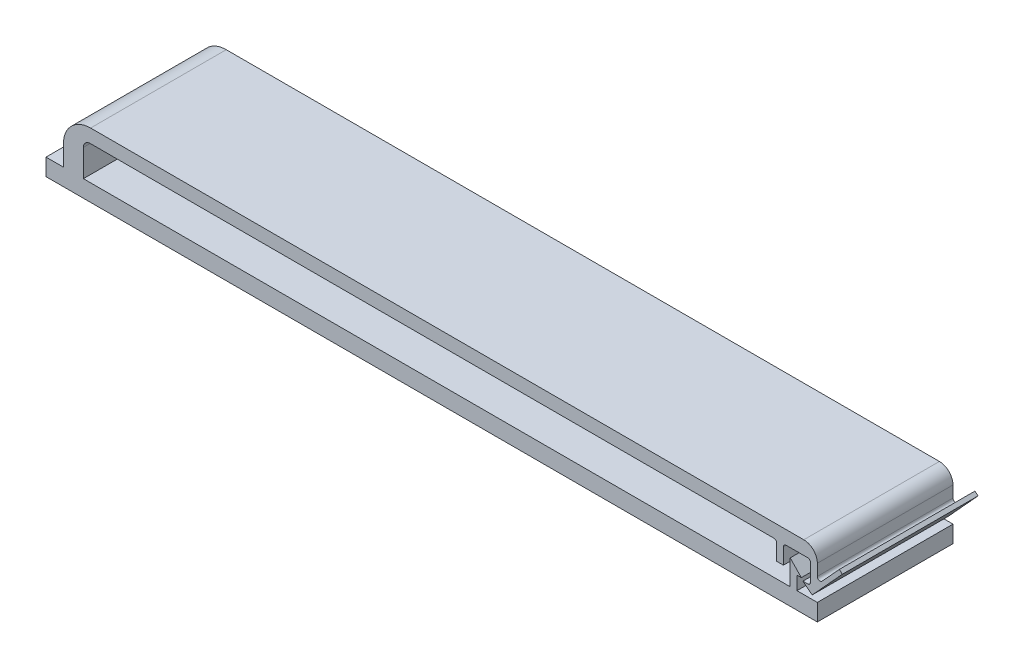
ISO-10303-21;
HEADER;
FILE_DESCRIPTION(('STEP AP214'),'2;1');
FILE_NAME('part.step','',(''),(''),'','','');
FILE_SCHEMA(('AUTOMOTIVE_DESIGN { 1 0 10303 214 1 1 1 1 }'));
ENDSEC;
DATA;
#1=APPLICATION_CONTEXT('core data for automotive mechanical design processes');
#2=APPLICATION_PROTOCOL_DEFINITION('international standard','automotive_design',2000,#1);
#3=PRODUCT_CONTEXT('',#1,'mechanical');
#4=PRODUCT('Part','Part','',(#3));
#5=PRODUCT_RELATED_PRODUCT_CATEGORY('part','',(#4));
#6=PRODUCT_DEFINITION_FORMATION('','',#4);
#7=PRODUCT_DEFINITION_CONTEXT('part definition',#1,'design');
#8=PRODUCT_DEFINITION('design','',#6,#7);
#9=PRODUCT_DEFINITION_SHAPE('','',#8);
#10=(LENGTH_UNIT() NAMED_UNIT(*) SI_UNIT(.MILLI.,.METRE.));
#11=(NAMED_UNIT(*) PLANE_ANGLE_UNIT() SI_UNIT($,.RADIAN.));
#12=(NAMED_UNIT(*) SI_UNIT($,.STERADIAN.) SOLID_ANGLE_UNIT());
#13=UNCERTAINTY_MEASURE_WITH_UNIT(LENGTH_MEASURE(1.E-05),#10,'distance_accuracy_value','');
#14=(GEOMETRIC_REPRESENTATION_CONTEXT(3) GLOBAL_UNCERTAINTY_ASSIGNED_CONTEXT((#13)) GLOBAL_UNIT_ASSIGNED_CONTEXT((#10,
#11,#12)) REPRESENTATION_CONTEXT('',''));
#15=CARTESIAN_POINT('',(0.,0.,0.));
#16=DIRECTION('',(0.,0.,1.));
#17=DIRECTION('',(1.,0.,0.));
#18=AXIS2_PLACEMENT_3D('',#15,#16,#17);
#19=CARTESIAN_POINT('',(0.,0.,-12.7));
#20=DIRECTION('',(-1.,0.,0.));
#21=DIRECTION('',(0.,0.,1.));
#22=AXIS2_PLACEMENT_3D('',#19,#20,#21);
#23=PLANE('',#22);
#24=DIRECTION('',(0.,-1.,0.));
#25=VECTOR('',#24,1.);
#26=CARTESIAN_POINT('',(0.,0.,0.));
#27=LINE('',#26,#25);
#28=CARTESIAN_POINT('',(0.,1.5875,0.));
#29=VERTEX_POINT('',#28);
#30=CARTESIAN_POINT('',(0.,0.,0.));
#31=VERTEX_POINT('',#30);
#32=EDGE_CURVE('E363',#29,#31,#27,.T.);
#33=ORIENTED_EDGE('',*,*,#32,.F.);
#34=DIRECTION('',(0.,0.,1.));
#35=VECTOR('',#34,1.);
#36=CARTESIAN_POINT('',(0.,1.5875,-12.7));
#37=LINE('',#36,#35);
#38=CARTESIAN_POINT('',(0.,1.5875,-12.7));
#39=VERTEX_POINT('',#38);
#40=EDGE_CURVE('E271',#39,#29,#37,.T.);
#41=ORIENTED_EDGE('',*,*,#40,.F.);
#42=DIRECTION('',(0.,-1.,0.));
#43=VECTOR('',#42,1.);
#44=CARTESIAN_POINT('',(0.,0.,-12.7));
#45=LINE('',#44,#43);
#46=CARTESIAN_POINT('',(0.,0.,-12.7));
#47=VERTEX_POINT('',#46);
#48=EDGE_CURVE('E265',#39,#47,#45,.T.);
#49=ORIENTED_EDGE('',*,*,#48,.T.);
#50=DIRECTION('',(0.,0.,1.));
#51=VECTOR('',#50,1.);
#52=CARTESIAN_POINT('',(0.,0.,-12.7));
#53=LINE('',#52,#51);
#54=EDGE_CURVE('E247',#47,#31,#53,.T.);
#55=ORIENTED_EDGE('',*,*,#54,.T.);
#56=EDGE_LOOP('',(#33,#41,#49,#55));
#57=FACE_BOUND('',#56,.T.);
#58=ADVANCED_FACE('F34',(#57),#23,.T.);
#59=CARTESIAN_POINT('',(0.,1.5875,-12.7));
#60=DIRECTION('',(0.,1.,0.));
#61=DIRECTION('',(0.,0.,1.));
#62=AXIS2_PLACEMENT_3D('',#59,#60,#61);
#63=PLANE('',#62);
#64=DIRECTION('',(-1.,0.,0.));
#65=VECTOR('',#64,1.);
#66=CARTESIAN_POINT('',(0.,1.5875,0.));
#67=LINE('',#66,#65);
#68=CARTESIAN_POINT('',(1.63545364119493,1.5875,0.));
#69=VERTEX_POINT('',#68);
#70=EDGE_CURVE('E272',#69,#29,#67,.T.);
#71=ORIENTED_EDGE('',*,*,#70,.F.);
#72=DIRECTION('',(0.,0.,1.));
#73=VECTOR('',#72,1.);
#74=CARTESIAN_POINT('',(1.63545364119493,1.5875,-12.7));
#75=LINE('',#74,#73);
#76=CARTESIAN_POINT('',(1.63545364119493,1.5875,-12.7));
#77=VERTEX_POINT('',#76);
#78=EDGE_CURVE('E452',#77,#69,#75,.T.);
#79=ORIENTED_EDGE('',*,*,#78,.F.);
#80=DIRECTION('',(-1.,0.,0.));
#81=VECTOR('',#80,1.);
#82=CARTESIAN_POINT('',(0.,1.5875,-12.7));
#83=LINE('',#82,#81);
#84=EDGE_CURVE('E258',#77,#39,#83,.T.);
#85=ORIENTED_EDGE('',*,*,#84,.T.);
#86=ORIENTED_EDGE('',*,*,#40,.T.);
#87=EDGE_LOOP('',(#71,#79,#85,#86));
#88=FACE_BOUND('',#87,.T.);
#89=ADVANCED_FACE('F533',(#88),#63,.T.);
#90=CARTESIAN_POINT('',(1.63545364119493,1.5875,-12.7));
#91=DIRECTION('',(-1.,0.,0.));
#92=DIRECTION('',(0.,-1.,0.));
#93=AXIS2_PLACEMENT_3D('',#90,#91,#92);
#94=PLANE('',#93);
#95=DIRECTION('',(0.,-1.,0.));
#96=VECTOR('',#95,1.);
#97=CARTESIAN_POINT('',(1.63545364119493,1.5875,0.));
#98=LINE('',#97,#96);
#99=CARTESIAN_POINT('',(1.63545364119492,3.4925,0.));
#100=VERTEX_POINT('',#99);
#101=EDGE_CURVE('E275',#100,#69,#98,.T.);
#102=ORIENTED_EDGE('',*,*,#101,.F.);
#103=DIRECTION('',(0.,0.,1.));
#104=VECTOR('',#103,1.);
#105=CARTESIAN_POINT('',(1.63545364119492,3.4925,-12.7));
#106=LINE('',#105,#104);
#107=CARTESIAN_POINT('',(1.63545364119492,3.4925,-12.7));
#108=VERTEX_POINT('',#107);
#109=EDGE_CURVE('E454',#108,#100,#106,.T.);
#110=ORIENTED_EDGE('',*,*,#109,.F.);
#111=DIRECTION('',(0.,-1.,0.));
#112=VECTOR('',#111,1.);
#113=CARTESIAN_POINT('',(1.63545364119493,1.5875,-12.7));
#114=LINE('',#113,#112);
#115=EDGE_CURVE('E359',#108,#77,#114,.T.);
#116=ORIENTED_EDGE('',*,*,#115,.T.);
#117=ORIENTED_EDGE('',*,*,#78,.T.);
#118=EDGE_LOOP('',(#102,#110,#116,#117));
#119=FACE_BOUND('',#118,.T.);
#120=ADVANCED_FACE('F537',(#119),#94,.T.);
#121=CARTESIAN_POINT('',(4.17545364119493,3.4925,-12.7));
#122=DIRECTION('',(0.,0.,1.));
#123=DIRECTION('',(1.,0.,0.));
#124=AXIS2_PLACEMENT_3D('',#121,#122,#123);
#125=CYLINDRICAL_SURFACE('',#124,2.54);
#126=CARTESIAN_POINT('',(4.17545364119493,3.4925,0.));
#127=DIRECTION('',(0.,0.,1.));
#128=DIRECTION('',(-1.,0.,0.));
#129=AXIS2_PLACEMENT_3D('',#126,#127,#128);
#130=CIRCLE('',#129,2.54);
#131=CARTESIAN_POINT('',(4.17545364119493,6.0325,0.));
#132=VERTEX_POINT('',#131);
#133=EDGE_CURVE('E445',#132,#100,#130,.T.);
#134=ORIENTED_EDGE('',*,*,#133,.F.);
#135=DIRECTION('',(0.,0.,1.));
#136=VECTOR('',#135,1.);
#137=CARTESIAN_POINT('',(4.17545364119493,6.0325,-12.7));
#138=LINE('',#137,#136);
#139=CARTESIAN_POINT('',(4.17545364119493,6.0325,-12.7));
#140=VERTEX_POINT('',#139);
#141=EDGE_CURVE('E456',#140,#132,#138,.T.);
#142=ORIENTED_EDGE('',*,*,#141,.F.);
#143=CARTESIAN_POINT('',(4.17545364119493,3.4925,-12.7));
#144=DIRECTION('',(0.,0.,1.));
#145=DIRECTION('',(-1.,0.,0.));
#146=AXIS2_PLACEMENT_3D('',#143,#144,#145);
#147=CIRCLE('',#146,2.54);
#148=EDGE_CURVE('E356',#140,#108,#147,.T.);
#149=ORIENTED_EDGE('',*,*,#148,.T.);
#150=ORIENTED_EDGE('',*,*,#109,.T.);
#151=EDGE_LOOP('',(#134,#142,#149,#150));
#152=FACE_BOUND('',#151,.T.);
#153=ADVANCED_FACE('F646',(#152),#125,.T.);
#154=CARTESIAN_POINT('',(4.17545364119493,6.0325,-12.7));
#155=DIRECTION('',(0.,1.,0.));
#156=DIRECTION('',(0.,0.,1.));
#157=AXIS2_PLACEMENT_3D('',#154,#155,#156);
#158=PLANE('',#157);
#159=DIRECTION('',(-1.,0.,0.));
#160=VECTOR('',#159,1.);
#161=CARTESIAN_POINT('',(4.17545364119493,6.0325,0.));
#162=LINE('',#161,#160);
#163=CARTESIAN_POINT('',(70.9422,6.0325,0.));
#164=VERTEX_POINT('',#163);
#165=EDGE_CURVE('E443',#164,#132,#162,.T.);
#166=ORIENTED_EDGE('',*,*,#165,.F.);
#167=DIRECTION('',(0.,0.,1.));
#168=VECTOR('',#167,1.);
#169=CARTESIAN_POINT('',(70.9422,6.0325,-12.7));
#170=LINE('',#169,#168);
#171=CARTESIAN_POINT('',(70.9422,6.0325,-12.7));
#172=VERTEX_POINT('',#171);
#173=EDGE_CURVE('E42',#164,#172,#170,.F.);
#174=ORIENTED_EDGE('',*,*,#173,.T.);
#175=DIRECTION('',(-1.,0.,0.));
#176=VECTOR('',#175,1.);
#177=CARTESIAN_POINT('',(4.17545364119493,6.0325,-12.7));
#178=LINE('',#177,#176);
#179=EDGE_CURVE('E354',#172,#140,#178,.T.);
#180=ORIENTED_EDGE('',*,*,#179,.T.);
#181=ORIENTED_EDGE('',*,*,#141,.T.);
#182=EDGE_LOOP('',(#166,#174,#180,#181));
#183=FACE_BOUND('',#182,.T.);
#184=ADVANCED_FACE('F643',(#183),#158,.T.);
#185=CARTESIAN_POINT('',(72.2122,6.0325,-12.7));
#186=DIRECTION('',(1.,0.,0.));
#187=DIRECTION('',(0.,0.,-1.));
#188=AXIS2_PLACEMENT_3D('',#185,#186,#187);
#189=PLANE('',#188);
#190=DIRECTION('',(0.,1.,0.));
#191=VECTOR('',#190,1.);
#192=CARTESIAN_POINT('',(72.2122,6.0325,-12.7));
#193=LINE('',#192,#191);
#194=CARTESIAN_POINT('',(72.2122,3.69855569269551,-12.7));
#195=VERTEX_POINT('',#194);
#196=CARTESIAN_POINT('',(72.2122,4.7625,-12.7));
#197=VERTEX_POINT('',#196);
#198=EDGE_CURVE('E351',#195,#197,#193,.T.);
#199=ORIENTED_EDGE('',*,*,#198,.T.);
#200=DIRECTION('',(0.,0.,1.));
#201=VECTOR('',#200,1.);
#202=CARTESIAN_POINT('',(72.2122,4.7625,-12.7));
#203=LINE('',#202,#201);
#204=CARTESIAN_POINT('',(72.2122,4.7625,0.));
#205=VERTEX_POINT('',#204);
#206=EDGE_CURVE('E451',#197,#205,#203,.T.);
#207=ORIENTED_EDGE('',*,*,#206,.T.);
#208=DIRECTION('',(0.,1.,0.));
#209=VECTOR('',#208,1.);
#210=CARTESIAN_POINT('',(72.2122,6.0325,0.));
#211=LINE('',#210,#209);
#212=CARTESIAN_POINT('',(72.2122,3.69855569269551,0.));
#213=VERTEX_POINT('',#212);
#214=EDGE_CURVE('E441',#213,#205,#211,.T.);
#215=ORIENTED_EDGE('',*,*,#214,.F.);
#216=DIRECTION('',(0.,0.,1.));
#217=VECTOR('',#216,1.);
#218=CARTESIAN_POINT('',(72.2122,3.69855569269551,-12.7));
#219=LINE('',#218,#217);
#220=EDGE_CURVE('E459',#195,#213,#219,.T.);
#221=ORIENTED_EDGE('',*,*,#220,.F.);
#222=EDGE_LOOP('',(#199,#207,#215,#221));
#223=FACE_BOUND('',#222,.T.);
#224=ADVANCED_FACE('F515',(#223),#189,.T.);
#225=CARTESIAN_POINT('',(72.4662,3.69855569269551,-12.7));
#226=DIRECTION('',(0.,0.,1.));
#227=DIRECTION('',(1.,0.,0.));
#228=AXIS2_PLACEMENT_3D('',#225,#226,#227);
#229=CYLINDRICAL_SURFACE('',#228,0.254000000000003);
#230=CARTESIAN_POINT('',(72.4662,3.69855569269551,0.));
#231=DIRECTION('',(0.,0.,-1.));
#232=DIRECTION('',(-1.,0.,0.));
#233=AXIS2_PLACEMENT_3D('',#230,#231,#232);
#234=CIRCLE('',#233,0.254000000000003);
#235=CARTESIAN_POINT('',(72.6536517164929,3.52715600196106,0.));
#236=VERTEX_POINT('',#235);
#237=EDGE_CURVE('E438',#236,#213,#234,.T.);
#238=ORIENTED_EDGE('',*,*,#237,.F.);
#239=DIRECTION('',(0.,0.,1.));
#240=VECTOR('',#239,1.);
#241=CARTESIAN_POINT('',(72.6536517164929,3.52715600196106,-12.7));
#242=LINE('',#241,#240);
#243=CARTESIAN_POINT('',(72.6536517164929,3.52715600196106,-12.7));
#244=VERTEX_POINT('',#243);
#245=EDGE_CURVE('E461',#244,#236,#242,.T.);
#246=ORIENTED_EDGE('',*,*,#245,.F.);
#247=CARTESIAN_POINT('',(72.4662,3.69855569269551,-12.7));
#248=DIRECTION('',(0.,0.,-1.));
#249=DIRECTION('',(-1.,0.,0.));
#250=AXIS2_PLACEMENT_3D('',#247,#248,#249);
#251=CIRCLE('',#250,0.254000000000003);
#252=EDGE_CURVE('E348',#244,#195,#251,.T.);
#253=ORIENTED_EDGE('',*,*,#252,.T.);
#254=ORIENTED_EDGE('',*,*,#220,.T.);
#255=EDGE_LOOP('',(#238,#246,#253,#254));
#256=FACE_BOUND('',#255,.T.);
#257=ADVANCED_FACE('F523',(#256),#229,.F.);
#258=CARTESIAN_POINT('',(74.2725780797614,5.29769901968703,-12.7));
#259=DIRECTION('',(-0.737998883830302,0.674801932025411,0.));
#260=DIRECTION('',(-0.674801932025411,-0.737998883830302,0.));
#261=AXIS2_PLACEMENT_3D('',#258,#259,#260);
#262=PLANE('',#261);
#263=DIRECTION('',(-0.674801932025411,-0.737998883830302,0.));
#264=VECTOR('',#263,1.);
#265=CARTESIAN_POINT('',(74.2725780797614,5.29769901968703,0.));
#266=LINE('',#265,#264);
#267=CARTESIAN_POINT('',(74.2725780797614,5.29769901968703,0.));
#268=VERTEX_POINT('',#267);
#269=EDGE_CURVE('E435',#268,#236,#266,.T.);
#270=ORIENTED_EDGE('',*,*,#269,.F.);
#271=DIRECTION('',(0.,0.,1.));
#272=VECTOR('',#271,1.);
#273=CARTESIAN_POINT('',(74.2725780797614,5.29769901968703,-12.7));
#274=LINE('',#273,#272);
#275=CARTESIAN_POINT('',(74.2725780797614,5.29769901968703,-12.7));
#276=VERTEX_POINT('',#275);
#277=EDGE_CURVE('E463',#276,#268,#274,.T.);
#278=ORIENTED_EDGE('',*,*,#277,.F.);
#279=DIRECTION('',(-0.674801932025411,-0.737998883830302,0.));
#280=VECTOR('',#279,1.);
#281=CARTESIAN_POINT('',(74.2725780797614,5.29769901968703,-12.7));
#282=LINE('',#281,#280);
#283=EDGE_CURVE('E345',#276,#244,#282,.T.);
#284=ORIENTED_EDGE('',*,*,#283,.T.);
#285=ORIENTED_EDGE('',*,*,#245,.T.);
#286=EDGE_LOOP('',(#270,#278,#284,#285));
#287=FACE_BOUND('',#286,.T.);
#288=ADVANCED_FACE('F634',(#287),#262,.T.);
#289=CARTESIAN_POINT('',(74.5537556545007,5.04059948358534,-12.7));
#290=DIRECTION('',(0.674801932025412,0.737998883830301,0.));
#291=DIRECTION('',(-0.737998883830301,0.674801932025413,0.));
#292=AXIS2_PLACEMENT_3D('',#289,#290,#291);
#293=PLANE('',#292);
#294=DIRECTION('',(-0.737998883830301,0.674801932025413,0.));
#295=VECTOR('',#294,1.);
#296=CARTESIAN_POINT('',(74.5537556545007,5.04059948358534,0.));
#297=LINE('',#296,#295);
#298=CARTESIAN_POINT('',(74.5537556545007,5.04059948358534,0.));
#299=VERTEX_POINT('',#298);
#300=EDGE_CURVE('E432',#299,#268,#297,.T.);
#301=ORIENTED_EDGE('',*,*,#300,.F.);
#302=DIRECTION('',(0.,0.,1.));
#303=VECTOR('',#302,1.);
#304=CARTESIAN_POINT('',(74.5537556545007,5.04059948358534,-12.7));
#305=LINE('',#304,#303);
#306=CARTESIAN_POINT('',(74.5537556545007,5.04059948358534,-12.7));
#307=VERTEX_POINT('',#306);
#308=EDGE_CURVE('E465',#307,#299,#305,.T.);
#309=ORIENTED_EDGE('',*,*,#308,.F.);
#310=DIRECTION('',(-0.737998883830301,0.674801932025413,0.));
#311=VECTOR('',#310,1.);
#312=CARTESIAN_POINT('',(74.5537556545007,5.04059948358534,-12.7));
#313=LINE('',#312,#311);
#314=EDGE_CURVE('E342',#307,#276,#313,.T.);
#315=ORIENTED_EDGE('',*,*,#314,.T.);
#316=ORIENTED_EDGE('',*,*,#277,.T.);
#317=EDGE_LOOP('',(#301,#309,#315,#316));
#318=FACE_BOUND('',#317,.T.);
#319=ADVANCED_FACE('F630',(#318),#293,.T.);
#320=CARTESIAN_POINT('',(74.5537556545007,5.04059948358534,-12.7));
#321=DIRECTION('',(0.737998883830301,-0.674801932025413,0.));
#322=DIRECTION('',(0.674801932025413,0.737998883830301,0.));
#323=AXIS2_PLACEMENT_3D('',#320,#321,#322);
#324=PLANE('',#323);
#325=DIRECTION('',(0.674801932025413,0.737998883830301,0.));
#326=VECTOR('',#325,1.);
#327=CARTESIAN_POINT('',(74.5537556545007,5.04059948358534,0.));
#328=LINE('',#327,#326);
#329=CARTESIAN_POINT('',(71.7330861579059,1.95576697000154,0.));
#330=VERTEX_POINT('',#329);
#331=EDGE_CURVE('E429',#330,#299,#328,.T.);
#332=ORIENTED_EDGE('',*,*,#331,.F.);
#333=DIRECTION('',(0.,0.,1.));
#334=VECTOR('',#333,1.);
#335=CARTESIAN_POINT('',(71.7330861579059,1.95576697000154,-12.7));
#336=LINE('',#335,#334);
#337=CARTESIAN_POINT('',(71.7330861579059,1.95576697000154,-12.7));
#338=VERTEX_POINT('',#337);
#339=EDGE_CURVE('E467',#338,#330,#336,.T.);
#340=ORIENTED_EDGE('',*,*,#339,.F.);
#341=DIRECTION('',(0.674801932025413,0.737998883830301,0.));
#342=VECTOR('',#341,1.);
#343=CARTESIAN_POINT('',(74.5537556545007,5.04059948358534,-12.7));
#344=LINE('',#343,#342);
#345=EDGE_CURVE('E339',#338,#307,#344,.T.);
#346=ORIENTED_EDGE('',*,*,#345,.T.);
#347=ORIENTED_EDGE('',*,*,#308,.T.);
#348=EDGE_LOOP('',(#332,#340,#346,#347));
#349=FACE_BOUND('',#348,.T.);
#350=ADVANCED_FACE('F626',(#349),#324,.T.);
#351=CARTESIAN_POINT('',(70.8585502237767,2.63397851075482,-12.7));
#352=DIRECTION('',(-0.612823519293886,-0.790219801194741,0.));
#353=DIRECTION('',(0.790219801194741,-0.612823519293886,0.));
#354=AXIS2_PLACEMENT_3D('',#351,#352,#353);
#355=PLANE('',#354);
#356=DIRECTION('',(0.790219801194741,-0.612823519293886,0.));
#357=VECTOR('',#356,1.);
#358=CARTESIAN_POINT('',(70.8585502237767,2.63397851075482,0.));
#359=LINE('',#358,#357);
#360=CARTESIAN_POINT('',(70.8585502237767,2.63397851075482,0.));
#361=VERTEX_POINT('',#360);
#362=EDGE_CURVE('E426',#361,#330,#359,.T.);
#363=ORIENTED_EDGE('',*,*,#362,.F.);
#364=DIRECTION('',(0.,0.,1.));
#365=VECTOR('',#364,1.);
#366=CARTESIAN_POINT('',(70.8585502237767,2.63397851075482,-12.7));
#367=LINE('',#366,#365);
#368=CARTESIAN_POINT('',(70.8585502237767,2.63397851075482,-12.7));
#369=VERTEX_POINT('',#368);
#370=EDGE_CURVE('E469',#369,#361,#367,.T.);
#371=ORIENTED_EDGE('',*,*,#370,.F.);
#372=DIRECTION('',(0.790219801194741,-0.612823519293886,0.));
#373=VECTOR('',#372,1.);
#374=CARTESIAN_POINT('',(70.8585502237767,2.63397851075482,-12.7));
#375=LINE('',#374,#373);
#376=EDGE_CURVE('E336',#369,#338,#375,.T.);
#377=ORIENTED_EDGE('',*,*,#376,.T.);
#378=ORIENTED_EDGE('',*,*,#339,.T.);
#379=EDGE_LOOP('',(#363,#371,#377,#378));
#380=FACE_BOUND('',#379,.T.);
#381=ADVANCED_FACE('F622',(#380),#355,.T.);
#382=CARTESIAN_POINT('',(71.3232,2.63397851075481,-12.7));
#383=DIRECTION('',(0.,1.,0.));
#384=DIRECTION('',(-1.,0.,0.));
#385=AXIS2_PLACEMENT_3D('',#382,#383,#384);
#386=PLANE('',#385);
#387=DIRECTION('',(-1.,0.,0.));
#388=VECTOR('',#387,1.);
#389=CARTESIAN_POINT('',(71.3232,2.63397851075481,0.));
#390=LINE('',#389,#388);
#391=CARTESIAN_POINT('',(71.3232,2.63397851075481,0.));
#392=VERTEX_POINT('',#391);
#393=EDGE_CURVE('E423',#392,#361,#390,.T.);
#394=ORIENTED_EDGE('',*,*,#393,.F.);
#395=DIRECTION('',(0.,0.,1.));
#396=VECTOR('',#395,1.);
#397=CARTESIAN_POINT('',(71.3232,2.63397851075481,-12.7));
#398=LINE('',#397,#396);
#399=CARTESIAN_POINT('',(71.3232,2.63397851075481,-12.7));
#400=VERTEX_POINT('',#399);
#401=EDGE_CURVE('E471',#400,#392,#398,.T.);
#402=ORIENTED_EDGE('',*,*,#401,.F.);
#403=DIRECTION('',(-1.,0.,0.));
#404=VECTOR('',#403,1.);
#405=CARTESIAN_POINT('',(71.3232,2.63397851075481,-12.7));
#406=LINE('',#405,#404);
#407=EDGE_CURVE('E333',#400,#369,#406,.T.);
#408=ORIENTED_EDGE('',*,*,#407,.T.);
#409=ORIENTED_EDGE('',*,*,#370,.T.);
#410=EDGE_LOOP('',(#394,#402,#408,#409));
#411=FACE_BOUND('',#410,.T.);
#412=ADVANCED_FACE('F618',(#411),#386,.T.);
#413=CARTESIAN_POINT('',(71.3232,2.88797851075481,-12.7));
#414=DIRECTION('',(0.,0.,1.));
#415=DIRECTION('',(1.,0.,0.));
#416=AXIS2_PLACEMENT_3D('',#413,#414,#415);
#417=CYLINDRICAL_SURFACE('',#416,0.254000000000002);
#418=CARTESIAN_POINT('',(71.3232,2.88797851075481,0.));
#419=DIRECTION('',(0.,0.,-1.));
#420=DIRECTION('',(1.,0.,0.));
#421=AXIS2_PLACEMENT_3D('',#418,#419,#420);
#422=CIRCLE('',#421,0.254000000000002);
#423=CARTESIAN_POINT('',(71.5772,2.88797851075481,0.));
#424=VERTEX_POINT('',#423);
#425=EDGE_CURVE('E420',#424,#392,#422,.T.);
#426=ORIENTED_EDGE('',*,*,#425,.F.);
#427=DIRECTION('',(0.,0.,1.));
#428=VECTOR('',#427,1.);
#429=CARTESIAN_POINT('',(71.5772,2.88797851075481,-12.7));
#430=LINE('',#429,#428);
#431=CARTESIAN_POINT('',(71.5772,2.88797851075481,-12.7));
#432=VERTEX_POINT('',#431);
#433=EDGE_CURVE('E473',#432,#424,#430,.T.);
#434=ORIENTED_EDGE('',*,*,#433,.F.);
#435=CARTESIAN_POINT('',(71.3232,2.88797851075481,-12.7));
#436=DIRECTION('',(0.,0.,-1.));
#437=DIRECTION('',(1.,0.,0.));
#438=AXIS2_PLACEMENT_3D('',#435,#436,#437);
#439=CIRCLE('',#438,0.254000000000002);
#440=EDGE_CURVE('E330',#432,#400,#439,.T.);
#441=ORIENTED_EDGE('',*,*,#440,.T.);
#442=ORIENTED_EDGE('',*,*,#401,.T.);
#443=EDGE_LOOP('',(#426,#434,#441,#442));
#444=FACE_BOUND('',#443,.T.);
#445=ADVANCED_FACE('F614',(#444),#417,.F.);
#446=CARTESIAN_POINT('',(71.5772,2.88797851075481,-12.7));
#447=DIRECTION('',(-1.,0.,0.));
#448=DIRECTION('',(0.,0.,1.));
#449=AXIS2_PLACEMENT_3D('',#446,#447,#448);
#450=PLANE('',#449);
#451=DIRECTION('',(0.,-1.,0.));
#452=VECTOR('',#451,1.);
#453=CARTESIAN_POINT('',(71.5772,2.88797851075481,0.));
#454=LINE('',#453,#452);
#455=CARTESIAN_POINT('',(71.5772,4.50850000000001,0.));
#456=VERTEX_POINT('',#455);
#457=EDGE_CURVE('E417',#456,#424,#454,.T.);
#458=ORIENTED_EDGE('',*,*,#457,.F.);
#459=DIRECTION('',(0.,0.,1.));
#460=VECTOR('',#459,1.);
#461=CARTESIAN_POINT('',(71.5772,4.50850000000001,-12.7));
#462=LINE('',#461,#460);
#463=CARTESIAN_POINT('',(71.5772,4.50850000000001,-12.7));
#464=VERTEX_POINT('',#463);
#465=EDGE_CURVE('E475',#464,#456,#462,.T.);
#466=ORIENTED_EDGE('',*,*,#465,.F.);
#467=DIRECTION('',(0.,-1.,0.));
#468=VECTOR('',#467,1.);
#469=CARTESIAN_POINT('',(71.5772,2.88797851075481,-12.7));
#470=LINE('',#469,#468);
#471=EDGE_CURVE('E327',#464,#432,#470,.T.);
#472=ORIENTED_EDGE('',*,*,#471,.T.);
#473=ORIENTED_EDGE('',*,*,#433,.T.);
#474=EDGE_LOOP('',(#458,#466,#472,#473));
#475=FACE_BOUND('',#474,.T.);
#476=ADVANCED_FACE('F610',(#475),#450,.T.);
#477=CARTESIAN_POINT('',(71.3232,4.50850000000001,-12.7));
#478=DIRECTION('',(0.,0.,1.));
#479=DIRECTION('',(1.,0.,0.));
#480=AXIS2_PLACEMENT_3D('',#477,#478,#479);
#481=CYLINDRICAL_SURFACE('',#480,0.254000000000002);
#482=CARTESIAN_POINT('',(71.3232,4.50850000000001,0.));
#483=DIRECTION('',(0.,0.,-1.));
#484=DIRECTION('',(1.,0.,0.));
#485=AXIS2_PLACEMENT_3D('',#482,#483,#484);
#486=CIRCLE('',#485,0.254000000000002);
#487=CARTESIAN_POINT('',(71.3232,4.76250000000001,0.));
#488=VERTEX_POINT('',#487);
#489=EDGE_CURVE('E414',#488,#456,#486,.T.);
#490=ORIENTED_EDGE('',*,*,#489,.F.);
#491=DIRECTION('',(0.,0.,1.));
#492=VECTOR('',#491,1.);
#493=CARTESIAN_POINT('',(71.3232,4.76250000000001,-12.7));
#494=LINE('',#493,#492);
#495=CARTESIAN_POINT('',(71.3232,4.76250000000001,-12.7));
#496=VERTEX_POINT('',#495);
#497=EDGE_CURVE('E477',#496,#488,#494,.T.);
#498=ORIENTED_EDGE('',*,*,#497,.F.);
#499=CARTESIAN_POINT('',(71.3232,4.50850000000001,-12.7));
#500=DIRECTION('',(0.,0.,-1.));
#501=DIRECTION('',(1.,0.,0.));
#502=AXIS2_PLACEMENT_3D('',#499,#500,#501);
#503=CIRCLE('',#502,0.254000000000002);
#504=EDGE_CURVE('E324',#496,#464,#503,.T.);
#505=ORIENTED_EDGE('',*,*,#504,.T.);
#506=ORIENTED_EDGE('',*,*,#465,.T.);
#507=EDGE_LOOP('',(#490,#498,#505,#506));
#508=FACE_BOUND('',#507,.T.);
#509=ADVANCED_FACE('F606',(#508),#481,.F.);
#510=CARTESIAN_POINT('',(71.3232,4.76250000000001,-12.7));
#511=DIRECTION('',(0.,-1.,0.));
#512=DIRECTION('',(1.,0.,0.));
#513=AXIS2_PLACEMENT_3D('',#510,#511,#512);
#514=PLANE('',#513);
#515=DIRECTION('',(1.,0.,0.));
#516=VECTOR('',#515,1.);
#517=CARTESIAN_POINT('',(71.3232,4.76250000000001,0.));
#518=LINE('',#517,#516);
#519=CARTESIAN_POINT('',(69.2912,4.76250000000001,0.));
#520=VERTEX_POINT('',#519);
#521=EDGE_CURVE('E411',#520,#488,#518,.T.);
#522=ORIENTED_EDGE('',*,*,#521,.F.);
#523=DIRECTION('',(0.,0.,1.));
#524=VECTOR('',#523,1.);
#525=CARTESIAN_POINT('',(69.2912,4.76250000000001,-12.7));
#526=LINE('',#525,#524);
#527=CARTESIAN_POINT('',(69.2912,4.76250000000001,-12.7));
#528=VERTEX_POINT('',#527);
#529=EDGE_CURVE('E479',#528,#520,#526,.T.);
#530=ORIENTED_EDGE('',*,*,#529,.F.);
#531=DIRECTION('',(1.,0.,0.));
#532=VECTOR('',#531,1.);
#533=CARTESIAN_POINT('',(71.3232,4.76250000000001,-12.7));
#534=LINE('',#533,#532);
#535=EDGE_CURVE('E321',#528,#496,#534,.T.);
#536=ORIENTED_EDGE('',*,*,#535,.T.);
#537=ORIENTED_EDGE('',*,*,#497,.T.);
#538=EDGE_LOOP('',(#522,#530,#536,#537));
#539=FACE_BOUND('',#538,.T.);
#540=ADVANCED_FACE('F602',(#539),#514,.T.);
#541=CARTESIAN_POINT('',(69.2912,4.50850000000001,-12.7));
#542=DIRECTION('',(0.,0.,1.));
#543=DIRECTION('',(1.,0.,0.));
#544=AXIS2_PLACEMENT_3D('',#541,#542,#543);
#545=CYLINDRICAL_SURFACE('',#544,0.254000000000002);
#546=CARTESIAN_POINT('',(69.2912,4.50850000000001,0.));
#547=DIRECTION('',(0.,0.,-1.));
#548=DIRECTION('',(1.,0.,0.));
#549=AXIS2_PLACEMENT_3D('',#546,#547,#548);
#550=CIRCLE('',#549,0.254000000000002);
#551=CARTESIAN_POINT('',(69.0372,4.50850000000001,0.));
#552=VERTEX_POINT('',#551);
#553=EDGE_CURVE('E408',#552,#520,#550,.T.);
#554=ORIENTED_EDGE('',*,*,#553,.F.);
#555=DIRECTION('',(0.,0.,1.));
#556=VECTOR('',#555,1.);
#557=CARTESIAN_POINT('',(69.0372,4.50850000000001,-12.7));
#558=LINE('',#557,#556);
#559=CARTESIAN_POINT('',(69.0372,4.50850000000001,-12.7));
#560=VERTEX_POINT('',#559);
#561=EDGE_CURVE('E481',#560,#552,#558,.T.);
#562=ORIENTED_EDGE('',*,*,#561,.F.);
#563=CARTESIAN_POINT('',(69.2912,4.50850000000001,-12.7));
#564=DIRECTION('',(0.,0.,-1.));
#565=DIRECTION('',(1.,0.,0.));
#566=AXIS2_PLACEMENT_3D('',#563,#564,#565);
#567=CIRCLE('',#566,0.254000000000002);
#568=EDGE_CURVE('E318',#560,#528,#567,.T.);
#569=ORIENTED_EDGE('',*,*,#568,.T.);
#570=ORIENTED_EDGE('',*,*,#529,.T.);
#571=EDGE_LOOP('',(#554,#562,#569,#570));
#572=FACE_BOUND('',#571,.T.);
#573=ADVANCED_FACE('F598',(#572),#545,.F.);
#574=CARTESIAN_POINT('',(69.0372,4.50850000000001,-12.7));
#575=DIRECTION('',(1.,0.,0.));
#576=DIRECTION('',(0.,0.,-1.));
#577=AXIS2_PLACEMENT_3D('',#574,#575,#576);
#578=PLANE('',#577);
#579=DIRECTION('',(0.,1.,0.));
#580=VECTOR('',#579,1.);
#581=CARTESIAN_POINT('',(69.0372,4.50850000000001,0.));
#582=LINE('',#581,#580);
#583=CARTESIAN_POINT('',(69.0372,3.01761684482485,0.));
#584=VERTEX_POINT('',#583);
#585=EDGE_CURVE('E405',#584,#552,#582,.T.);
#586=ORIENTED_EDGE('',*,*,#585,.F.);
#587=DIRECTION('',(0.,0.,1.));
#588=VECTOR('',#587,1.);
#589=CARTESIAN_POINT('',(69.0372,3.01761684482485,-12.7));
#590=LINE('',#589,#588);
#591=CARTESIAN_POINT('',(69.0372,3.01761684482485,-12.7));
#592=VERTEX_POINT('',#591);
#593=EDGE_CURVE('E483',#592,#584,#590,.T.);
#594=ORIENTED_EDGE('',*,*,#593,.F.);
#595=DIRECTION('',(0.,1.,0.));
#596=VECTOR('',#595,1.);
#597=CARTESIAN_POINT('',(69.0372,4.50850000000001,-12.7));
#598=LINE('',#597,#596);
#599=EDGE_CURVE('E315',#592,#560,#598,.T.);
#600=ORIENTED_EDGE('',*,*,#599,.T.);
#601=ORIENTED_EDGE('',*,*,#561,.T.);
#602=EDGE_LOOP('',(#586,#594,#600,#601));
#603=FACE_BOUND('',#602,.T.);
#604=ADVANCED_FACE('F594',(#603),#578,.T.);
#605=CARTESIAN_POINT('',(68.4022,3.01761684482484,-12.7));
#606=DIRECTION('',(0.,-1.,0.));
#607=DIRECTION('',(1.,0.,0.));
#608=AXIS2_PLACEMENT_3D('',#605,#606,#607);
#609=PLANE('',#608);
#610=DIRECTION('',(1.,0.,0.));
#611=VECTOR('',#610,1.);
#612=CARTESIAN_POINT('',(68.4022,3.01761684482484,0.));
#613=LINE('',#612,#611);
#614=CARTESIAN_POINT('',(68.4022,3.01761684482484,0.));
#615=VERTEX_POINT('',#614);
#616=EDGE_CURVE('E402',#615,#584,#613,.T.);
#617=ORIENTED_EDGE('',*,*,#616,.F.);
#618=DIRECTION('',(0.,0.,1.));
#619=VECTOR('',#618,1.);
#620=CARTESIAN_POINT('',(68.4022,3.01761684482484,-12.7));
#621=LINE('',#620,#619);
#622=CARTESIAN_POINT('',(68.4022,3.01761684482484,-12.7));
#623=VERTEX_POINT('',#622);
#624=EDGE_CURVE('E485',#623,#615,#621,.T.);
#625=ORIENTED_EDGE('',*,*,#624,.F.);
#626=DIRECTION('',(1.,0.,0.));
#627=VECTOR('',#626,1.);
#628=CARTESIAN_POINT('',(68.4022,3.01761684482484,-12.7));
#629=LINE('',#628,#627);
#630=EDGE_CURVE('E312',#623,#592,#629,.T.);
#631=ORIENTED_EDGE('',*,*,#630,.T.);
#632=ORIENTED_EDGE('',*,*,#593,.T.);
#633=EDGE_LOOP('',(#617,#625,#631,#632));
#634=FACE_BOUND('',#633,.T.);
#635=ADVANCED_FACE('F590',(#634),#609,.T.);
#636=CARTESIAN_POINT('',(68.4022,4.50850000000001,-12.7));
#637=DIRECTION('',(-1.,0.,0.));
#638=DIRECTION('',(0.,0.,1.));
#639=AXIS2_PLACEMENT_3D('',#636,#637,#638);
#640=PLANE('',#639);
#641=DIRECTION('',(0.,-1.,0.));
#642=VECTOR('',#641,1.);
#643=CARTESIAN_POINT('',(68.4022,4.50850000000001,0.));
#644=LINE('',#643,#642);
#645=CARTESIAN_POINT('',(68.4022,4.50850000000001,0.));
#646=VERTEX_POINT('',#645);
#647=EDGE_CURVE('E399',#646,#615,#644,.T.);
#648=ORIENTED_EDGE('',*,*,#647,.F.);
#649=DIRECTION('',(0.,0.,1.));
#650=VECTOR('',#649,1.);
#651=CARTESIAN_POINT('',(68.4022,4.50850000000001,-12.7));
#652=LINE('',#651,#650);
#653=CARTESIAN_POINT('',(68.4022,4.50850000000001,-12.7));
#654=VERTEX_POINT('',#653);
#655=EDGE_CURVE('E487',#654,#646,#652,.T.);
#656=ORIENTED_EDGE('',*,*,#655,.F.);
#657=DIRECTION('',(0.,-1.,0.));
#658=VECTOR('',#657,1.);
#659=CARTESIAN_POINT('',(68.4022,4.50850000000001,-12.7));
#660=LINE('',#659,#658);
#661=EDGE_CURVE('E309',#654,#623,#660,.T.);
#662=ORIENTED_EDGE('',*,*,#661,.T.);
#663=ORIENTED_EDGE('',*,*,#624,.T.);
#664=EDGE_LOOP('',(#648,#656,#662,#663));
#665=FACE_BOUND('',#664,.T.);
#666=ADVANCED_FACE('F586',(#665),#640,.T.);
#667=CARTESIAN_POINT('',(68.1482,4.50850000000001,-12.7));
#668=DIRECTION('',(0.,0.,1.));
#669=DIRECTION('',(1.,0.,0.));
#670=AXIS2_PLACEMENT_3D('',#667,#668,#669);
#671=CYLINDRICAL_SURFACE('',#670,0.254000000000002);
#672=CARTESIAN_POINT('',(68.1482,4.50850000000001,0.));
#673=DIRECTION('',(0.,0.,-1.));
#674=DIRECTION('',(-1.,0.,0.));
#675=AXIS2_PLACEMENT_3D('',#672,#673,#674);
#676=CIRCLE('',#675,0.254000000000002);
#677=CARTESIAN_POINT('',(68.1482,4.76250000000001,0.));
#678=VERTEX_POINT('',#677);
#679=EDGE_CURVE('E396',#678,#646,#676,.T.);
#680=ORIENTED_EDGE('',*,*,#679,.F.);
#681=DIRECTION('',(0.,0.,1.));
#682=VECTOR('',#681,1.);
#683=CARTESIAN_POINT('',(68.1482,4.76250000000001,-12.7));
#684=LINE('',#683,#682);
#685=CARTESIAN_POINT('',(68.1482,4.76250000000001,-12.7));
#686=VERTEX_POINT('',#685);
#687=EDGE_CURVE('E489',#686,#678,#684,.T.);
#688=ORIENTED_EDGE('',*,*,#687,.F.);
#689=CARTESIAN_POINT('',(68.1482,4.50850000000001,-12.7));
#690=DIRECTION('',(0.,0.,-1.));
#691=DIRECTION('',(-1.,0.,0.));
#692=AXIS2_PLACEMENT_3D('',#689,#690,#691);
#693=CIRCLE('',#692,0.254000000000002);
#694=EDGE_CURVE('E306',#686,#654,#693,.T.);
#695=ORIENTED_EDGE('',*,*,#694,.T.);
#696=ORIENTED_EDGE('',*,*,#655,.T.);
#697=EDGE_LOOP('',(#680,#688,#695,#696));
#698=FACE_BOUND('',#697,.T.);
#699=ADVANCED_FACE('F582',(#698),#671,.F.);
#700=CARTESIAN_POINT('',(68.1482,4.76250000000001,-12.7));
#701=DIRECTION('',(0.,-1.,0.));
#702=DIRECTION('',(1.,0.,0.));
#703=AXIS2_PLACEMENT_3D('',#700,#701,#702);
#704=PLANE('',#703);
#705=DIRECTION('',(1.,0.,0.));
#706=VECTOR('',#705,1.);
#707=CARTESIAN_POINT('',(68.1482,4.76250000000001,0.));
#708=LINE('',#707,#706);
#709=CARTESIAN_POINT('',(4.13551007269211,4.7625,0.));
#710=VERTEX_POINT('',#709);
#711=EDGE_CURVE('E393',#710,#678,#708,.T.);
#712=ORIENTED_EDGE('',*,*,#711,.F.);
#713=DIRECTION('',(0.,0.,1.));
#714=VECTOR('',#713,1.);
#715=CARTESIAN_POINT('',(4.13551007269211,4.7625,-12.7));
#716=LINE('',#715,#714);
#717=CARTESIAN_POINT('',(4.13551007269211,4.7625,-12.7));
#718=VERTEX_POINT('',#717);
#719=EDGE_CURVE('E491',#718,#710,#716,.T.);
#720=ORIENTED_EDGE('',*,*,#719,.F.);
#721=DIRECTION('',(1.,0.,0.));
#722=VECTOR('',#721,1.);
#723=CARTESIAN_POINT('',(68.1482,4.76250000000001,-12.7));
#724=LINE('',#723,#722);
#725=EDGE_CURVE('E303',#718,#686,#724,.T.);
#726=ORIENTED_EDGE('',*,*,#725,.T.);
#727=ORIENTED_EDGE('',*,*,#687,.T.);
#728=EDGE_LOOP('',(#712,#720,#726,#727));
#729=FACE_BOUND('',#728,.T.);
#730=ADVANCED_FACE('F578',(#729),#704,.T.);
#731=CARTESIAN_POINT('',(4.13551007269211,4.1275,-12.7));
#732=DIRECTION('',(0.,0.,1.));
#733=DIRECTION('',(1.,0.,0.));
#734=AXIS2_PLACEMENT_3D('',#731,#732,#733);
#735=CYLINDRICAL_SURFACE('',#734,0.635);
#736=CARTESIAN_POINT('',(4.13551007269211,4.1275,0.));
#737=DIRECTION('',(0.,0.,-1.));
#738=DIRECTION('',(1.,0.,0.));
#739=AXIS2_PLACEMENT_3D('',#736,#737,#738);
#740=CIRCLE('',#739,0.635);
#741=CARTESIAN_POINT('',(3.50051007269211,4.1275,0.));
#742=VERTEX_POINT('',#741);
#743=EDGE_CURVE('E390',#742,#710,#740,.T.);
#744=ORIENTED_EDGE('',*,*,#743,.F.);
#745=DIRECTION('',(0.,0.,1.));
#746=VECTOR('',#745,1.);
#747=CARTESIAN_POINT('',(3.50051007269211,4.1275,-12.7));
#748=LINE('',#747,#746);
#749=CARTESIAN_POINT('',(3.50051007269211,4.1275,-12.7));
#750=VERTEX_POINT('',#749);
#751=EDGE_CURVE('E493',#750,#742,#748,.T.);
#752=ORIENTED_EDGE('',*,*,#751,.F.);
#753=CARTESIAN_POINT('',(4.13551007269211,4.1275,-12.7));
#754=DIRECTION('',(0.,0.,-1.));
#755=DIRECTION('',(1.,0.,0.));
#756=AXIS2_PLACEMENT_3D('',#753,#754,#755);
#757=CIRCLE('',#756,0.635);
#758=EDGE_CURVE('E300',#750,#718,#757,.T.);
#759=ORIENTED_EDGE('',*,*,#758,.T.);
#760=ORIENTED_EDGE('',*,*,#719,.T.);
#761=EDGE_LOOP('',(#744,#752,#759,#760));
#762=FACE_BOUND('',#761,.T.);
#763=ADVANCED_FACE('F574',(#762),#735,.F.);
#764=CARTESIAN_POINT('',(3.50051007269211,4.1275,-12.7));
#765=DIRECTION('',(1.,0.,0.));
#766=DIRECTION('',(0.,1.,0.));
#767=AXIS2_PLACEMENT_3D('',#764,#765,#766);
#768=PLANE('',#767);
#769=DIRECTION('',(0.,1.,0.));
#770=VECTOR('',#769,1.);
#771=CARTESIAN_POINT('',(3.50051007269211,4.1275,0.));
#772=LINE('',#771,#770);
#773=CARTESIAN_POINT('',(3.50051007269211,1.5875,0.));
#774=VERTEX_POINT('',#773);
#775=EDGE_CURVE('E387',#774,#742,#772,.T.);
#776=ORIENTED_EDGE('',*,*,#775,.F.);
#777=DIRECTION('',(0.,0.,1.));
#778=VECTOR('',#777,1.);
#779=CARTESIAN_POINT('',(3.50051007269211,1.5875,-12.7));
#780=LINE('',#779,#778);
#781=CARTESIAN_POINT('',(3.50051007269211,1.5875,-12.7));
#782=VERTEX_POINT('',#781);
#783=EDGE_CURVE('E495',#782,#774,#780,.T.);
#784=ORIENTED_EDGE('',*,*,#783,.F.);
#785=DIRECTION('',(0.,1.,0.));
#786=VECTOR('',#785,1.);
#787=CARTESIAN_POINT('',(3.50051007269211,4.1275,-12.7));
#788=LINE('',#787,#786);
#789=EDGE_CURVE('E297',#782,#750,#788,.T.);
#790=ORIENTED_EDGE('',*,*,#789,.T.);
#791=ORIENTED_EDGE('',*,*,#751,.T.);
#792=EDGE_LOOP('',(#776,#784,#790,#791));
#793=FACE_BOUND('',#792,.T.);
#794=ADVANCED_FACE('F570',(#793),#768,.T.);
#795=CARTESIAN_POINT('',(3.50051007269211,1.5875,-12.7));
#796=DIRECTION('',(0.,1.,0.));
#797=DIRECTION('',(0.,0.,1.));
#798=AXIS2_PLACEMENT_3D('',#795,#796,#797);
#799=PLANE('',#798);
#800=DIRECTION('',(-1.,0.,0.));
#801=VECTOR('',#800,1.);
#802=CARTESIAN_POINT('',(3.50051007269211,1.5875,0.));
#803=LINE('',#802,#801);
#804=CARTESIAN_POINT('',(69.6722,1.5875,0.));
#805=VERTEX_POINT('',#804);
#806=EDGE_CURVE('E384',#805,#774,#803,.T.);
#807=ORIENTED_EDGE('',*,*,#806,.F.);
#808=DIRECTION('',(0.,0.,1.));
#809=VECTOR('',#808,1.);
#810=CARTESIAN_POINT('',(69.6722,1.5875,-12.7));
#811=LINE('',#810,#809);
#812=CARTESIAN_POINT('',(69.6722,1.5875,-12.7));
#813=VERTEX_POINT('',#812);
#814=EDGE_CURVE('E497',#813,#805,#811,.T.);
#815=ORIENTED_EDGE('',*,*,#814,.F.);
#816=DIRECTION('',(-1.,0.,0.));
#817=VECTOR('',#816,1.);
#818=CARTESIAN_POINT('',(3.50051007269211,1.5875,-12.7));
#819=LINE('',#818,#817);
#820=EDGE_CURVE('E294',#813,#782,#819,.T.);
#821=ORIENTED_EDGE('',*,*,#820,.T.);
#822=ORIENTED_EDGE('',*,*,#783,.T.);
#823=EDGE_LOOP('',(#807,#815,#821,#822));
#824=FACE_BOUND('',#823,.T.);
#825=ADVANCED_FACE('F566',(#824),#799,.T.);
#826=CARTESIAN_POINT('',(69.6722,3.93048647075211,-12.7));
#827=DIRECTION('',(-1.,0.,0.));
#828=DIRECTION('',(0.,0.,1.));
#829=AXIS2_PLACEMENT_3D('',#826,#827,#828);
#830=PLANE('',#829);
#831=DIRECTION('',(0.,-1.,0.));
#832=VECTOR('',#831,1.);
#833=CARTESIAN_POINT('',(69.6722,3.93048647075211,0.));
#834=LINE('',#833,#832);
#835=CARTESIAN_POINT('',(69.6722,3.93048647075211,0.));
#836=VERTEX_POINT('',#835);
#837=EDGE_CURVE('E381',#836,#805,#834,.T.);
#838=ORIENTED_EDGE('',*,*,#837,.F.);
#839=DIRECTION('',(0.,0.,1.));
#840=VECTOR('',#839,1.);
#841=CARTESIAN_POINT('',(69.6722,3.93048647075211,-12.7));
#842=LINE('',#841,#840);
#843=CARTESIAN_POINT('',(69.6722,3.93048647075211,-12.7));
#844=VERTEX_POINT('',#843);
#845=EDGE_CURVE('E499',#844,#836,#842,.T.);
#846=ORIENTED_EDGE('',*,*,#845,.F.);
#847=DIRECTION('',(0.,-1.,0.));
#848=VECTOR('',#847,1.);
#849=CARTESIAN_POINT('',(69.6722,3.93048647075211,-12.7));
#850=LINE('',#849,#848);
#851=EDGE_CURVE('E291',#844,#813,#850,.T.);
#852=ORIENTED_EDGE('',*,*,#851,.T.);
#853=ORIENTED_EDGE('',*,*,#814,.T.);
#854=EDGE_LOOP('',(#838,#846,#852,#853));
#855=FACE_BOUND('',#854,.T.);
#856=ADVANCED_FACE('F562',(#855),#830,.T.);
#857=CARTESIAN_POINT('',(70.713191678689,2.84601331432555,-12.7));
#858=DIRECTION('',(0.721421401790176,0.69249632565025,0.));
#859=DIRECTION('',(-0.69249632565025,0.721421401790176,0.));
#860=AXIS2_PLACEMENT_3D('',#857,#858,#859);
#861=PLANE('',#860);
#862=DIRECTION('',(-0.69249632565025,0.721421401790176,0.));
#863=VECTOR('',#862,1.);
#864=CARTESIAN_POINT('',(70.713191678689,2.84601331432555,0.));
#865=LINE('',#864,#863);
#866=CARTESIAN_POINT('',(70.713191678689,2.84601331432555,0.));
#867=VERTEX_POINT('',#866);
#868=EDGE_CURVE('E378',#867,#836,#865,.T.);
#869=ORIENTED_EDGE('',*,*,#868,.F.);
#870=DIRECTION('',(0.,0.,1.));
#871=VECTOR('',#870,1.);
#872=CARTESIAN_POINT('',(70.713191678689,2.84601331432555,-12.7));
#873=LINE('',#872,#871);
#874=CARTESIAN_POINT('',(70.713191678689,2.84601331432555,-12.7));
#875=VERTEX_POINT('',#874);
#876=EDGE_CURVE('E501',#875,#867,#873,.T.);
#877=ORIENTED_EDGE('',*,*,#876,.F.);
#878=DIRECTION('',(-0.69249632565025,0.721421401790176,0.));
#879=VECTOR('',#878,1.);
#880=CARTESIAN_POINT('',(70.713191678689,2.84601331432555,-12.7));
#881=LINE('',#880,#879);
#882=EDGE_CURVE('E288',#875,#844,#881,.T.);
#883=ORIENTED_EDGE('',*,*,#882,.T.);
#884=ORIENTED_EDGE('',*,*,#845,.T.);
#885=EDGE_LOOP('',(#869,#877,#883,#884));
#886=FACE_BOUND('',#885,.T.);
#887=ADVANCED_FACE('F558',(#886),#861,.T.);
#888=CARTESIAN_POINT('',(70.3072,2.84601331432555,-12.7));
#889=DIRECTION('',(0.,-1.,0.));
#890=DIRECTION('',(1.,0.,0.));
#891=AXIS2_PLACEMENT_3D('',#888,#889,#890);
#892=PLANE('',#891);
#893=DIRECTION('',(1.,0.,0.));
#894=VECTOR('',#893,1.);
#895=CARTESIAN_POINT('',(70.3072,2.84601331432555,0.));
#896=LINE('',#895,#894);
#897=CARTESIAN_POINT('',(70.3072,2.84601331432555,0.));
#898=VERTEX_POINT('',#897);
#899=EDGE_CURVE('E375',#898,#867,#896,.T.);
#900=ORIENTED_EDGE('',*,*,#899,.F.);
#901=DIRECTION('',(0.,0.,1.));
#902=VECTOR('',#901,1.);
#903=CARTESIAN_POINT('',(70.3072,2.84601331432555,-12.7));
#904=LINE('',#903,#902);
#905=CARTESIAN_POINT('',(70.3072,2.84601331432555,-12.7));
#906=VERTEX_POINT('',#905);
#907=EDGE_CURVE('E503',#906,#898,#904,.T.);
#908=ORIENTED_EDGE('',*,*,#907,.F.);
#909=DIRECTION('',(1.,0.,0.));
#910=VECTOR('',#909,1.);
#911=CARTESIAN_POINT('',(70.3072,2.84601331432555,-12.7));
#912=LINE('',#911,#910);
#913=EDGE_CURVE('E285',#906,#875,#912,.T.);
#914=ORIENTED_EDGE('',*,*,#913,.T.);
#915=ORIENTED_EDGE('',*,*,#876,.T.);
#916=EDGE_LOOP('',(#900,#908,#914,#915));
#917=FACE_BOUND('',#916,.T.);
#918=ADVANCED_FACE('F554',(#917),#892,.T.);
#919=CARTESIAN_POINT('',(70.3072,1.5875,-12.7));
#920=DIRECTION('',(1.,0.,0.));
#921=DIRECTION('',(0.,0.,-1.));
#922=AXIS2_PLACEMENT_3D('',#919,#920,#921);
#923=PLANE('',#922);
#924=DIRECTION('',(0.,1.,0.));
#925=VECTOR('',#924,1.);
#926=CARTESIAN_POINT('',(70.3072,1.5875,0.));
#927=LINE('',#926,#925);
#928=CARTESIAN_POINT('',(70.3072,1.5875,0.));
#929=VERTEX_POINT('',#928);
#930=EDGE_CURVE('E372',#929,#898,#927,.T.);
#931=ORIENTED_EDGE('',*,*,#930,.F.);
#932=DIRECTION('',(0.,0.,1.));
#933=VECTOR('',#932,1.);
#934=CARTESIAN_POINT('',(70.3072,1.5875,-12.7));
#935=LINE('',#934,#933);
#936=CARTESIAN_POINT('',(70.3072,1.5875,-12.7));
#937=VERTEX_POINT('',#936);
#938=EDGE_CURVE('E505',#937,#929,#935,.T.);
#939=ORIENTED_EDGE('',*,*,#938,.F.);
#940=DIRECTION('',(0.,1.,0.));
#941=VECTOR('',#940,1.);
#942=CARTESIAN_POINT('',(70.3072,1.5875,-12.7));
#943=LINE('',#942,#941);
#944=EDGE_CURVE('E282',#937,#906,#943,.T.);
#945=ORIENTED_EDGE('',*,*,#944,.T.);
#946=ORIENTED_EDGE('',*,*,#907,.T.);
#947=EDGE_LOOP('',(#931,#939,#945,#946));
#948=FACE_BOUND('',#947,.T.);
#949=ADVANCED_FACE('F550',(#948),#923,.T.);
#950=CARTESIAN_POINT('',(70.3072,1.5875,-12.7));
#951=DIRECTION('',(0.,1.,0.));
#952=DIRECTION('',(0.,0.,1.));
#953=AXIS2_PLACEMENT_3D('',#950,#951,#952);
#954=PLANE('',#953);
#955=DIRECTION('',(-1.,0.,0.));
#956=VECTOR('',#955,1.);
#957=CARTESIAN_POINT('',(70.3072,1.5875,0.));
#958=LINE('',#957,#956);
#959=CARTESIAN_POINT('',(72.2122,1.5875,0.));
#960=VERTEX_POINT('',#959);
#961=EDGE_CURVE('E369',#960,#929,#958,.T.);
#962=ORIENTED_EDGE('',*,*,#961,.F.);
#963=DIRECTION('',(0.,0.,1.));
#964=VECTOR('',#963,1.);
#965=CARTESIAN_POINT('',(72.2122,1.5875,-12.7));
#966=LINE('',#965,#964);
#967=CARTESIAN_POINT('',(72.2122,1.5875,-12.7));
#968=VERTEX_POINT('',#967);
#969=EDGE_CURVE('E507',#968,#960,#966,.T.);
#970=ORIENTED_EDGE('',*,*,#969,.F.);
#971=DIRECTION('',(-1.,0.,0.));
#972=VECTOR('',#971,1.);
#973=CARTESIAN_POINT('',(70.3072,1.5875,-12.7));
#974=LINE('',#973,#972);
#975=EDGE_CURVE('E279',#968,#937,#974,.T.);
#976=ORIENTED_EDGE('',*,*,#975,.T.);
#977=ORIENTED_EDGE('',*,*,#938,.T.);
#978=EDGE_LOOP('',(#962,#970,#976,#977));
#979=FACE_BOUND('',#978,.T.);
#980=ADVANCED_FACE('F546',(#979),#954,.T.);
#981=CARTESIAN_POINT('',(72.2122,0.,-12.7));
#982=DIRECTION('',(1.,0.,0.));
#983=DIRECTION('',(0.,0.,-1.));
#984=AXIS2_PLACEMENT_3D('',#981,#982,#983);
#985=PLANE('',#984);
#986=DIRECTION('',(0.,1.,0.));
#987=VECTOR('',#986,1.);
#988=CARTESIAN_POINT('',(72.2122,0.,0.));
#989=LINE('',#988,#987);
#990=CARTESIAN_POINT('',(72.2122,0.,0.));
#991=VERTEX_POINT('',#990);
#992=EDGE_CURVE('E366',#991,#960,#989,.T.);
#993=ORIENTED_EDGE('',*,*,#992,.F.);
#994=DIRECTION('',(0.,0.,1.));
#995=VECTOR('',#994,1.);
#996=CARTESIAN_POINT('',(72.2122,0.,-12.7));
#997=LINE('',#996,#995);
#998=CARTESIAN_POINT('',(72.2122,0.,-12.7));
#999=VERTEX_POINT('',#998);
#1000=EDGE_CURVE('E257',#999,#991,#997,.T.);
#1001=ORIENTED_EDGE('',*,*,#1000,.F.);
#1002=DIRECTION('',(0.,1.,0.));
#1003=VECTOR('',#1002,1.);
#1004=CARTESIAN_POINT('',(72.2122,0.,-12.7));
#1005=LINE('',#1004,#1003);
#1006=EDGE_CURVE('E269',#999,#968,#1005,.T.);
#1007=ORIENTED_EDGE('',*,*,#1006,.T.);
#1008=ORIENTED_EDGE('',*,*,#969,.T.);
#1009=EDGE_LOOP('',(#993,#1001,#1007,#1008));
#1010=FACE_BOUND('',#1009,.T.);
#1011=ADVANCED_FACE('F543',(#1010),#985,.T.);
#1012=CARTESIAN_POINT('',(0.,0.,-12.7));
#1013=DIRECTION('',(0.,-1.,0.));
#1014=DIRECTION('',(0.,0.,-1.));
#1015=AXIS2_PLACEMENT_3D('',#1012,#1013,#1014);
#1016=PLANE('',#1015);
#1017=DIRECTION('',(1.,0.,0.));
#1018=VECTOR('',#1017,1.);
#1019=CARTESIAN_POINT('',(0.,0.,0.));
#1020=LINE('',#1019,#1018);
#1021=EDGE_CURVE('E252',#31,#991,#1020,.T.);
#1022=ORIENTED_EDGE('',*,*,#1021,.F.);
#1023=ORIENTED_EDGE('',*,*,#54,.F.);
#1024=DIRECTION('',(1.,0.,0.));
#1025=VECTOR('',#1024,1.);
#1026=CARTESIAN_POINT('',(0.,0.,-12.7));
#1027=LINE('',#1026,#1025);
#1028=EDGE_CURVE('E250',#47,#999,#1027,.T.);
#1029=ORIENTED_EDGE('',*,*,#1028,.T.);
#1030=ORIENTED_EDGE('',*,*,#1000,.T.);
#1031=EDGE_LOOP('',(#1022,#1023,#1029,#1030));
#1032=FACE_BOUND('',#1031,.T.);
#1033=ADVANCED_FACE('F249',(#1032),#1016,.T.);
#1034=CARTESIAN_POINT('',(4.17545364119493,3.4925,-12.7));
#1035=DIRECTION('',(0.,0.,-1.));
#1036=DIRECTION('',(-1.,0.,0.));
#1037=AXIS2_PLACEMENT_3D('',#1034,#1035,#1036);
#1038=PLANE('',#1037);
#1039=ORIENTED_EDGE('',*,*,#179,.F.);
#1040=CARTESIAN_POINT('',(70.9422,4.7625,-12.7));
#1041=DIRECTION('',(0.,0.,-1.));
#1042=DIRECTION('',(-1.,0.,0.));
#1043=AXIS2_PLACEMENT_3D('',#1040,#1041,#1042);
#1044=CIRCLE('',#1043,1.27);
#1045=EDGE_CURVE('E11',#172,#197,#1044,.T.);
#1046=ORIENTED_EDGE('',*,*,#1045,.T.);
#1047=ORIENTED_EDGE('',*,*,#198,.F.);
#1048=ORIENTED_EDGE('',*,*,#252,.F.);
#1049=ORIENTED_EDGE('',*,*,#283,.F.);
#1050=ORIENTED_EDGE('',*,*,#314,.F.);
#1051=ORIENTED_EDGE('',*,*,#345,.F.);
#1052=ORIENTED_EDGE('',*,*,#376,.F.);
#1053=ORIENTED_EDGE('',*,*,#407,.F.);
#1054=ORIENTED_EDGE('',*,*,#440,.F.);
#1055=ORIENTED_EDGE('',*,*,#471,.F.);
#1056=ORIENTED_EDGE('',*,*,#504,.F.);
#1057=ORIENTED_EDGE('',*,*,#535,.F.);
#1058=ORIENTED_EDGE('',*,*,#568,.F.);
#1059=ORIENTED_EDGE('',*,*,#599,.F.);
#1060=ORIENTED_EDGE('',*,*,#630,.F.);
#1061=ORIENTED_EDGE('',*,*,#661,.F.);
#1062=ORIENTED_EDGE('',*,*,#694,.F.);
#1063=ORIENTED_EDGE('',*,*,#725,.F.);
#1064=ORIENTED_EDGE('',*,*,#758,.F.);
#1065=ORIENTED_EDGE('',*,*,#789,.F.);
#1066=ORIENTED_EDGE('',*,*,#820,.F.);
#1067=ORIENTED_EDGE('',*,*,#851,.F.);
#1068=ORIENTED_EDGE('',*,*,#882,.F.);
#1069=ORIENTED_EDGE('',*,*,#913,.F.);
#1070=ORIENTED_EDGE('',*,*,#944,.F.);
#1071=ORIENTED_EDGE('',*,*,#975,.F.);
#1072=ORIENTED_EDGE('',*,*,#1006,.F.);
#1073=ORIENTED_EDGE('',*,*,#1028,.F.);
#1074=ORIENTED_EDGE('',*,*,#48,.F.);
#1075=ORIENTED_EDGE('',*,*,#84,.F.);
#1076=ORIENTED_EDGE('',*,*,#115,.F.);
#1077=ORIENTED_EDGE('',*,*,#148,.F.);
#1078=EDGE_LOOP('',(#1039,#1046,#1047,#1048,#1049,#1050,#1051,#1052,#1053,#1054,#1055,#1056,
#1057,#1058,#1059,#1060,#1061,#1062,#1063,#1064,#1065,#1066,#1067,#1068,#1069,#1070,#1071,#1072,
#1073,#1074,#1075,#1076,#1077));
#1079=FACE_BOUND('',#1078,.T.);
#1080=ADVANCED_FACE('F263',(#1079),#1038,.T.);
#1081=CARTESIAN_POINT('',(4.17545364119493,3.4925,0.));
#1082=DIRECTION('',(0.,0.,-1.));
#1083=DIRECTION('',(-1.,0.,0.));
#1084=AXIS2_PLACEMENT_3D('',#1081,#1082,#1083);
#1085=PLANE('',#1084);
#1086=ORIENTED_EDGE('',*,*,#214,.T.);
#1087=CARTESIAN_POINT('',(70.9422,4.7625,0.));
#1088=DIRECTION('',(0.,0.,-1.));
#1089=DIRECTION('',(-1.,0.,0.));
#1090=AXIS2_PLACEMENT_3D('',#1087,#1088,#1089);
#1091=CIRCLE('',#1090,1.27);
#1092=EDGE_CURVE('E56',#205,#164,#1091,.F.);
#1093=ORIENTED_EDGE('',*,*,#1092,.T.);
#1094=ORIENTED_EDGE('',*,*,#165,.T.);
#1095=ORIENTED_EDGE('',*,*,#133,.T.);
#1096=ORIENTED_EDGE('',*,*,#101,.T.);
#1097=ORIENTED_EDGE('',*,*,#70,.T.);
#1098=ORIENTED_EDGE('',*,*,#32,.T.);
#1099=ORIENTED_EDGE('',*,*,#1021,.T.);
#1100=ORIENTED_EDGE('',*,*,#992,.T.);
#1101=ORIENTED_EDGE('',*,*,#961,.T.);
#1102=ORIENTED_EDGE('',*,*,#930,.T.);
#1103=ORIENTED_EDGE('',*,*,#899,.T.);
#1104=ORIENTED_EDGE('',*,*,#868,.T.);
#1105=ORIENTED_EDGE('',*,*,#837,.T.);
#1106=ORIENTED_EDGE('',*,*,#806,.T.);
#1107=ORIENTED_EDGE('',*,*,#775,.T.);
#1108=ORIENTED_EDGE('',*,*,#743,.T.);
#1109=ORIENTED_EDGE('',*,*,#711,.T.);
#1110=ORIENTED_EDGE('',*,*,#679,.T.);
#1111=ORIENTED_EDGE('',*,*,#647,.T.);
#1112=ORIENTED_EDGE('',*,*,#616,.T.);
#1113=ORIENTED_EDGE('',*,*,#585,.T.);
#1114=ORIENTED_EDGE('',*,*,#553,.T.);
#1115=ORIENTED_EDGE('',*,*,#521,.T.);
#1116=ORIENTED_EDGE('',*,*,#489,.T.);
#1117=ORIENTED_EDGE('',*,*,#457,.T.);
#1118=ORIENTED_EDGE('',*,*,#425,.T.);
#1119=ORIENTED_EDGE('',*,*,#393,.T.);
#1120=ORIENTED_EDGE('',*,*,#362,.T.);
#1121=ORIENTED_EDGE('',*,*,#331,.T.);
#1122=ORIENTED_EDGE('',*,*,#300,.T.);
#1123=ORIENTED_EDGE('',*,*,#269,.T.);
#1124=ORIENTED_EDGE('',*,*,#237,.T.);
#1125=EDGE_LOOP('',(#1086,#1093,#1094,#1095,#1096,#1097,#1098,#1099,#1100,#1101,#1102,#1103,
#1104,#1105,#1106,#1107,#1108,#1109,#1110,#1111,#1112,#1113,#1114,#1115,#1116,#1117,#1118,#1119,
#1120,#1121,#1122,#1123,#1124));
#1126=FACE_BOUND('',#1125,.T.);
#1127=ADVANCED_FACE('F519',(#1126),#1085,.F.);
#1128=CARTESIAN_POINT('',(70.9422,4.7625,-12.7));
#1129=DIRECTION('',(0.,0.,1.));
#1130=DIRECTION('',(1.,0.,0.));
#1131=AXIS2_PLACEMENT_3D('',#1128,#1129,#1130);
#1132=CYLINDRICAL_SURFACE('',#1131,1.27);
#1133=ORIENTED_EDGE('',*,*,#1045,.F.);
#1134=ORIENTED_EDGE('',*,*,#173,.F.);
#1135=ORIENTED_EDGE('',*,*,#1092,.F.);
#1136=ORIENTED_EDGE('',*,*,#206,.F.);
#1137=EDGE_LOOP('',(#1133,#1134,#1135,#1136));
#1138=FACE_BOUND('',#1137,.T.);
#1139=ADVANCED_FACE('F36',(#1138),#1132,.T.);
#1140=CLOSED_SHELL('',(#58,#89,#120,#153,#184,#224,#257,#288,#319,#350,#381,#412,#445,#476,#509,
#540,#573,#604,#635,#666,#699,#730,#763,#794,#825,#856,#887,#918,#949,#980,#1011,#1033,#1080,
#1127,#1139));
#1141=MANIFOLD_SOLID_BREP('B2',#1140);
#1142=ADVANCED_BREP_SHAPE_REPRESENTATION('',(#18,#1141),#14);
#1143=SHAPE_DEFINITION_REPRESENTATION(#9,#1142);
ENDSEC;
END-ISO-10303-21;
